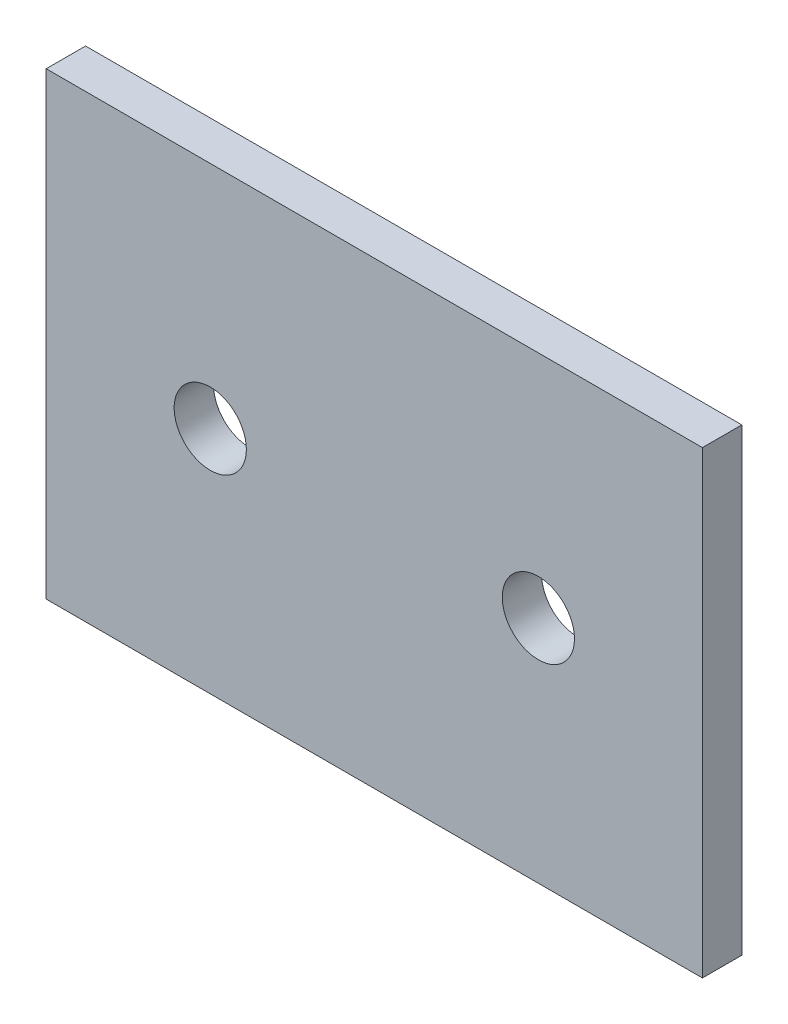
ISO-10303-21;
HEADER;
FILE_DESCRIPTION(('STEP AP214'),'2;1');
FILE_NAME('part.step','',(''),(''),'','','');
FILE_SCHEMA(('AUTOMOTIVE_DESIGN { 1 0 10303 214 1 1 1 1 }'));
ENDSEC;
DATA;
#1=APPLICATION_CONTEXT('core data for automotive mechanical design processes');
#2=APPLICATION_PROTOCOL_DEFINITION('international standard','automotive_design',2000,#1);
#3=PRODUCT_CONTEXT('',#1,'mechanical');
#4=PRODUCT('Part','Part','',(#3));
#5=PRODUCT_RELATED_PRODUCT_CATEGORY('part','',(#4));
#6=PRODUCT_DEFINITION_FORMATION('','',#4);
#7=PRODUCT_DEFINITION_CONTEXT('part definition',#1,'design');
#8=PRODUCT_DEFINITION('design','',#6,#7);
#9=PRODUCT_DEFINITION_SHAPE('','',#8);
#10=(LENGTH_UNIT() NAMED_UNIT(*) SI_UNIT(.MILLI.,.METRE.));
#11=(NAMED_UNIT(*) PLANE_ANGLE_UNIT() SI_UNIT($,.RADIAN.));
#12=(NAMED_UNIT(*) SI_UNIT($,.STERADIAN.) SOLID_ANGLE_UNIT());
#13=UNCERTAINTY_MEASURE_WITH_UNIT(LENGTH_MEASURE(1.E-05),#10,'distance_accuracy_value','');
#14=(GEOMETRIC_REPRESENTATION_CONTEXT(3) GLOBAL_UNCERTAINTY_ASSIGNED_CONTEXT((#13)) GLOBAL_UNIT_ASSIGNED_CONTEXT((#10,
#11,#12)) REPRESENTATION_CONTEXT('',''));
#15=CARTESIAN_POINT('',(0.,0.,0.));
#16=DIRECTION('',(0.,0.,1.));
#17=DIRECTION('',(1.,0.,0.));
#18=AXIS2_PLACEMENT_3D('',#15,#16,#17);
#19=CARTESIAN_POINT('',(0.,0.,6.));
#20=DIRECTION('',(0.,0.,1.));
#21=DIRECTION('',(1.,0.,0.));
#22=AXIS2_PLACEMENT_3D('',#19,#20,#21);
#23=PLANE('',#22);
#24=CARTESIAN_POINT('',(25.,0.,6.));
#25=DIRECTION('',(0.,0.,1.));
#26=DIRECTION('',(1.,0.,0.));
#27=AXIS2_PLACEMENT_3D('',#24,#25,#26);
#28=CIRCLE('',#27,5.5);
#29=CARTESIAN_POINT('',(30.5,0.,6.));
#30=VERTEX_POINT('',#29);
#31=EDGE_CURVE('E25',#30,#30,#28,.T.);
#32=ORIENTED_EDGE('',*,*,#31,.F.);
#33=EDGE_LOOP('',(#32));
#34=FACE_BOUND('',#33,.T.);
#35=CARTESIAN_POINT('',(-25.,0.,6.));
#36=DIRECTION('',(0.,0.,1.));
#37=DIRECTION('',(1.,0.,0.));
#38=AXIS2_PLACEMENT_3D('',#35,#36,#37);
#39=CIRCLE('',#38,5.5);
#40=CARTESIAN_POINT('',(-19.5,0.,6.));
#41=VERTEX_POINT('',#40);
#42=EDGE_CURVE('E60',#41,#41,#39,.T.);
#43=ORIENTED_EDGE('',*,*,#42,.F.);
#44=EDGE_LOOP('',(#43));
#45=FACE_BOUND('',#44,.T.);
#46=DIRECTION('',(1.,0.,0.));
#47=VECTOR('',#46,1.);
#48=CARTESIAN_POINT('',(-50.,-35.,6.));
#49=LINE('',#48,#47);
#50=CARTESIAN_POINT('',(-50.,-35.,6.));
#51=VERTEX_POINT('',#50);
#52=CARTESIAN_POINT('',(50.,-35.,6.));
#53=VERTEX_POINT('',#52);
#54=EDGE_CURVE('E93',#51,#53,#49,.T.);
#55=ORIENTED_EDGE('',*,*,#54,.T.);
#56=DIRECTION('',(0.,1.,0.));
#57=VECTOR('',#56,1.);
#58=CARTESIAN_POINT('',(50.,-35.,6.));
#59=LINE('',#58,#57);
#60=CARTESIAN_POINT('',(50.,35.,6.));
#61=VERTEX_POINT('',#60);
#62=EDGE_CURVE('E108',#53,#61,#59,.T.);
#63=ORIENTED_EDGE('',*,*,#62,.T.);
#64=DIRECTION('',(-1.,0.,0.));
#65=VECTOR('',#64,1.);
#66=CARTESIAN_POINT('',(50.,35.,6.));
#67=LINE('',#66,#65);
#68=CARTESIAN_POINT('',(-50.,35.,6.));
#69=VERTEX_POINT('',#68);
#70=EDGE_CURVE('E98',#61,#69,#67,.T.);
#71=ORIENTED_EDGE('',*,*,#70,.T.);
#72=DIRECTION('',(0.,-1.,0.));
#73=VECTOR('',#72,1.);
#74=CARTESIAN_POINT('',(-50.,35.,6.));
#75=LINE('',#74,#73);
#76=EDGE_CURVE('E75',#69,#51,#75,.T.);
#77=ORIENTED_EDGE('',*,*,#76,.T.);
#78=EDGE_LOOP('',(#55,#63,#71,#77));
#79=FACE_BOUND('',#78,.T.);
#80=ADVANCED_FACE('F16',(#34,#45,#79),#23,.T.);
#81=CARTESIAN_POINT('',(0.,0.,0.));
#82=DIRECTION('',(0.,0.,1.));
#83=DIRECTION('',(1.,0.,0.));
#84=AXIS2_PLACEMENT_3D('',#81,#82,#83);
#85=PLANE('',#84);
#86=CARTESIAN_POINT('',(25.,0.,0.));
#87=DIRECTION('',(0.,0.,1.));
#88=DIRECTION('',(1.,0.,0.));
#89=AXIS2_PLACEMENT_3D('',#86,#87,#88);
#90=CIRCLE('',#89,5.5);
#91=CARTESIAN_POINT('',(30.5,0.,0.));
#92=VERTEX_POINT('',#91);
#93=EDGE_CURVE('E10',#92,#92,#90,.T.);
#94=ORIENTED_EDGE('',*,*,#93,.T.);
#95=EDGE_LOOP('',(#94));
#96=FACE_BOUND('',#95,.T.);
#97=CARTESIAN_POINT('',(-25.,0.,0.));
#98=DIRECTION('',(0.,0.,1.));
#99=DIRECTION('',(1.,0.,0.));
#100=AXIS2_PLACEMENT_3D('',#97,#98,#99);
#101=CIRCLE('',#100,5.5);
#102=CARTESIAN_POINT('',(-19.5,0.,0.));
#103=VERTEX_POINT('',#102);
#104=EDGE_CURVE('E66',#103,#103,#101,.T.);
#105=ORIENTED_EDGE('',*,*,#104,.T.);
#106=EDGE_LOOP('',(#105));
#107=FACE_BOUND('',#106,.T.);
#108=DIRECTION('',(0.,-1.,0.));
#109=VECTOR('',#108,1.);
#110=CARTESIAN_POINT('',(-50.,35.,0.));
#111=LINE('',#110,#109);
#112=CARTESIAN_POINT('',(-50.,35.,0.));
#113=VERTEX_POINT('',#112);
#114=CARTESIAN_POINT('',(-50.,-35.,0.));
#115=VERTEX_POINT('',#114);
#116=EDGE_CURVE('E82',#113,#115,#111,.T.);
#117=ORIENTED_EDGE('',*,*,#116,.F.);
#118=DIRECTION('',(-1.,0.,0.));
#119=VECTOR('',#118,1.);
#120=CARTESIAN_POINT('',(50.,35.,0.));
#121=LINE('',#120,#119);
#122=CARTESIAN_POINT('',(50.,35.,0.));
#123=VERTEX_POINT('',#122);
#124=EDGE_CURVE('E79',#123,#113,#121,.T.);
#125=ORIENTED_EDGE('',*,*,#124,.F.);
#126=DIRECTION('',(0.,1.,0.));
#127=VECTOR('',#126,1.);
#128=CARTESIAN_POINT('',(50.,-35.,0.));
#129=LINE('',#128,#127);
#130=CARTESIAN_POINT('',(50.,-35.,0.));
#131=VERTEX_POINT('',#130);
#132=EDGE_CURVE('E103',#131,#123,#129,.T.);
#133=ORIENTED_EDGE('',*,*,#132,.F.);
#134=DIRECTION('',(1.,0.,0.));
#135=VECTOR('',#134,1.);
#136=CARTESIAN_POINT('',(-50.,-35.,0.));
#137=LINE('',#136,#135);
#138=EDGE_CURVE('E147',#115,#131,#137,.T.);
#139=ORIENTED_EDGE('',*,*,#138,.F.);
#140=EDGE_LOOP('',(#117,#125,#133,#139));
#141=FACE_BOUND('',#140,.T.);
#142=ADVANCED_FACE('F178',(#96,#107,#141),#85,.F.);
#143=CARTESIAN_POINT('',(25.,0.,0.));
#144=DIRECTION('',(0.,0.,-1.));
#145=DIRECTION('',(1.,0.,0.));
#146=AXIS2_PLACEMENT_3D('',#143,#144,#145);
#147=CYLINDRICAL_SURFACE('',#146,5.5);
#148=DIRECTION('',(0.,0.,1.));
#149=VECTOR('',#148,1.);
#150=CARTESIAN_POINT('',(30.5,0.,0.));
#151=LINE('',#150,#149);
#152=EDGE_CURVE('E72',#92,#30,#151,.T.);
#153=ORIENTED_EDGE('',*,*,#152,.T.);
#154=ORIENTED_EDGE('',*,*,#31,.T.);
#155=ORIENTED_EDGE('',*,*,#152,.F.);
#156=ORIENTED_EDGE('',*,*,#93,.F.);
#157=EDGE_LOOP('',(#153,#154,#155,#156));
#158=FACE_BOUND('',#157,.T.);
#159=ADVANCED_FACE('F187',(#158),#147,.F.);
#160=CARTESIAN_POINT('',(-25.,0.,0.));
#161=DIRECTION('',(0.,0.,-1.));
#162=DIRECTION('',(1.,0.,0.));
#163=AXIS2_PLACEMENT_3D('',#160,#161,#162);
#164=CYLINDRICAL_SURFACE('',#163,5.5);
#165=DIRECTION('',(0.,0.,1.));
#166=VECTOR('',#165,1.);
#167=CARTESIAN_POINT('',(-19.5,0.,0.));
#168=LINE('',#167,#166);
#169=EDGE_CURVE('E63',#103,#41,#168,.T.);
#170=ORIENTED_EDGE('',*,*,#169,.T.);
#171=ORIENTED_EDGE('',*,*,#42,.T.);
#172=ORIENTED_EDGE('',*,*,#169,.F.);
#173=ORIENTED_EDGE('',*,*,#104,.F.);
#174=EDGE_LOOP('',(#170,#171,#172,#173));
#175=FACE_BOUND('',#174,.T.);
#176=ADVANCED_FACE('F61',(#175),#164,.F.);
#177=CARTESIAN_POINT('',(-50.,35.,0.));
#178=DIRECTION('',(1.,0.,0.));
#179=DIRECTION('',(0.,1.,0.));
#180=AXIS2_PLACEMENT_3D('',#177,#178,#179);
#181=PLANE('',#180);
#182=ORIENTED_EDGE('',*,*,#116,.T.);
#183=DIRECTION('',(0.,0.,1.));
#184=VECTOR('',#183,1.);
#185=CARTESIAN_POINT('',(-50.,-35.,0.));
#186=LINE('',#185,#184);
#187=EDGE_CURVE('E99',#115,#51,#186,.T.);
#188=ORIENTED_EDGE('',*,*,#187,.T.);
#189=ORIENTED_EDGE('',*,*,#76,.F.);
#190=DIRECTION('',(0.,0.,1.));
#191=VECTOR('',#190,1.);
#192=CARTESIAN_POINT('',(-50.,35.,0.));
#193=LINE('',#192,#191);
#194=EDGE_CURVE('E95',#113,#69,#193,.T.);
#195=ORIENTED_EDGE('',*,*,#194,.F.);
#196=EDGE_LOOP('',(#182,#188,#189,#195));
#197=FACE_BOUND('',#196,.T.);
#198=ADVANCED_FACE('F130',(#197),#181,.F.);
#199=CARTESIAN_POINT('',(50.,35.,0.));
#200=DIRECTION('',(0.,-1.,0.));
#201=DIRECTION('',(0.,0.,-1.));
#202=AXIS2_PLACEMENT_3D('',#199,#200,#201);
#203=PLANE('',#202);
#204=ORIENTED_EDGE('',*,*,#124,.T.);
#205=ORIENTED_EDGE('',*,*,#194,.T.);
#206=ORIENTED_EDGE('',*,*,#70,.F.);
#207=DIRECTION('',(0.,0.,1.));
#208=VECTOR('',#207,1.);
#209=CARTESIAN_POINT('',(50.,35.,0.));
#210=LINE('',#209,#208);
#211=EDGE_CURVE('E107',#123,#61,#210,.T.);
#212=ORIENTED_EDGE('',*,*,#211,.F.);
#213=EDGE_LOOP('',(#204,#205,#206,#212));
#214=FACE_BOUND('',#213,.T.);
#215=ADVANCED_FACE('F127',(#214),#203,.F.);
#216=CARTESIAN_POINT('',(50.,-35.,0.));
#217=DIRECTION('',(-1.,0.,0.));
#218=DIRECTION('',(0.,0.,1.));
#219=AXIS2_PLACEMENT_3D('',#216,#217,#218);
#220=PLANE('',#219);
#221=ORIENTED_EDGE('',*,*,#132,.T.);
#222=ORIENTED_EDGE('',*,*,#211,.T.);
#223=ORIENTED_EDGE('',*,*,#62,.F.);
#224=DIRECTION('',(0.,0.,1.));
#225=VECTOR('',#224,1.);
#226=CARTESIAN_POINT('',(50.,-35.,0.));
#227=LINE('',#226,#225);
#228=EDGE_CURVE('E144',#131,#53,#227,.T.);
#229=ORIENTED_EDGE('',*,*,#228,.F.);
#230=EDGE_LOOP('',(#221,#222,#223,#229));
#231=FACE_BOUND('',#230,.T.);
#232=ADVANCED_FACE('F155',(#231),#220,.F.);
#233=CARTESIAN_POINT('',(-50.,-35.,0.));
#234=DIRECTION('',(0.,1.,0.));
#235=DIRECTION('',(1.,0.,0.));
#236=AXIS2_PLACEMENT_3D('',#233,#234,#235);
#237=PLANE('',#236);
#238=ORIENTED_EDGE('',*,*,#138,.T.);
#239=ORIENTED_EDGE('',*,*,#228,.T.);
#240=ORIENTED_EDGE('',*,*,#54,.F.);
#241=ORIENTED_EDGE('',*,*,#187,.F.);
#242=EDGE_LOOP('',(#238,#239,#240,#241));
#243=FACE_BOUND('',#242,.T.);
#244=ADVANCED_FACE('F142',(#243),#237,.F.);
#245=CLOSED_SHELL('',(#80,#142,#159,#176,#198,#215,#232,#244));
#246=MANIFOLD_SOLID_BREP('B1',#245);
#247=ADVANCED_BREP_SHAPE_REPRESENTATION('',(#18,#246),#14);
#248=SHAPE_DEFINITION_REPRESENTATION(#9,#247);
ENDSEC;
END-ISO-10303-21;
